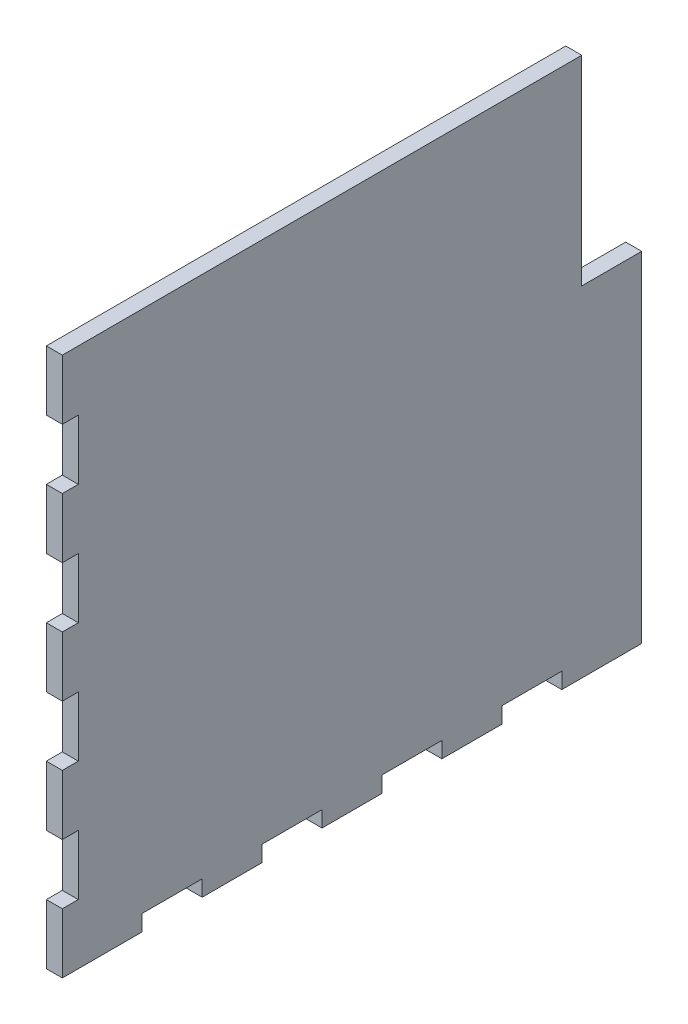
from build123d import *

# Parameters (mm, degrees)
BOSS_EXTRUDE1_DEPTH     = 4
CUT_EXTRUDE1_DEPTH      = 199.156503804
CUT_EXTRUDE1_DEPTH_BACK = 199.156503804
SKETCH2_W               = 15
SKETCH2_H               = 4
CUT_EXTRUDE2_DEPTH      = 199.156503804
CUT_EXTRUDE2_DEPTH_BACK = 199.156503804
SKETCH3_W               = 4
SKETCH3_H               = 15


with BuildPart() as part:
    # Sketch1 → Boss-Extrude1 (new body)
    with BuildSketch(Plane(origin=(0, 0, 0), x_dir=(0, 0, -1), z_dir=(1, 0, 0))):
        Polygon((0, 0), (0, 135), (130, 135), (130, 85), (145, 85), (145, 0), align=None)
    extrude(amount=BOSS_EXTRUDE1_DEPTH)

    # Sketch2 → Cut-Extrude1 (cut, two sides: drawn at the far end of the back side and taken through both)
    with BuildSketch(Plane(origin=(4, 0, 0), x_dir=(0, 0, -1), z_dir=(1, 0, 0)).offset(-CUT_EXTRUDE1_DEPTH_BACK)):
        with Locations((27.5, 2)):
            Rectangle(SKETCH2_W, SKETCH2_H)
        with Locations((57.5, 2)):
            Rectangle(SKETCH2_W, SKETCH2_H)
        with Locations((117.5, 2)):
            Rectangle(SKETCH2_W, SKETCH2_H)
        with Locations((87.5, 2)):
            Rectangle(SKETCH2_W, SKETCH2_H)
    extrude(amount=CUT_EXTRUDE1_DEPTH + CUT_EXTRUDE1_DEPTH_BACK, mode=Mode.SUBTRACT)

    # Sketch3 → Cut-Extrude2 (cut, two sides: drawn at the far end of the back side and taken through both)
    with BuildSketch(Plane(origin=(4, 0, 0), x_dir=(0, 0, -1), z_dir=(1, 0, 0)).offset(-CUT_EXTRUDE2_DEPTH_BACK)):
        with Locations((2, 112.5)):
            Rectangle(SKETCH3_W, SKETCH3_H)
        with Locations((2, 82.5)):
            Rectangle(SKETCH3_W, SKETCH3_H)
        with Locations((2, 52.5)):
            Rectangle(SKETCH3_W, SKETCH3_H)
        with Locations((2, 22.5)):
            Rectangle(SKETCH3_W, SKETCH3_H)
    extrude(amount=CUT_EXTRUDE2_DEPTH + CUT_EXTRUDE2_DEPTH_BACK, mode=Mode.SUBTRACT)


solid = part.part
